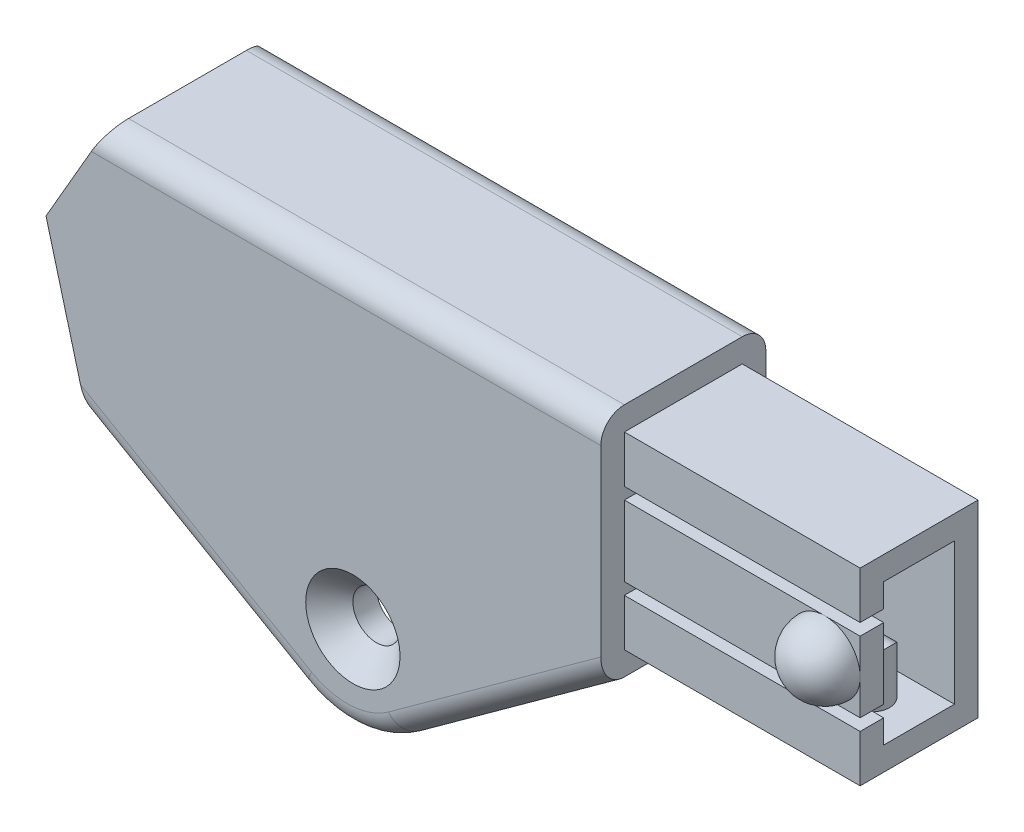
ISO-10303-21;
HEADER;
FILE_DESCRIPTION(('STEP AP214'),'2;1');
FILE_NAME('part.step','',(''),(''),'','','');
FILE_SCHEMA(('AUTOMOTIVE_DESIGN { 1 0 10303 214 1 1 1 1 }'));
ENDSEC;
DATA;
#1=APPLICATION_CONTEXT('core data for automotive mechanical design processes');
#2=APPLICATION_PROTOCOL_DEFINITION('international standard','automotive_design',2000,#1);
#3=PRODUCT_CONTEXT('',#1,'mechanical');
#4=PRODUCT('Part','Part','',(#3));
#5=PRODUCT_RELATED_PRODUCT_CATEGORY('part','',(#4));
#6=PRODUCT_DEFINITION_FORMATION('','',#4);
#7=PRODUCT_DEFINITION_CONTEXT('part definition',#1,'design');
#8=PRODUCT_DEFINITION('design','',#6,#7);
#9=PRODUCT_DEFINITION_SHAPE('','',#8);
#10=(LENGTH_UNIT() NAMED_UNIT(*) SI_UNIT(.MILLI.,.METRE.));
#11=(NAMED_UNIT(*) PLANE_ANGLE_UNIT() SI_UNIT($,.RADIAN.));
#12=(NAMED_UNIT(*) SI_UNIT($,.STERADIAN.) SOLID_ANGLE_UNIT());
#13=UNCERTAINTY_MEASURE_WITH_UNIT(LENGTH_MEASURE(1.E-05),#10,'distance_accuracy_value','');
#14=(GEOMETRIC_REPRESENTATION_CONTEXT(3) GLOBAL_UNCERTAINTY_ASSIGNED_CONTEXT((#13)) GLOBAL_UNIT_ASSIGNED_CONTEXT((#10,
#11,#12)) REPRESENTATION_CONTEXT('',''));
#15=CARTESIAN_POINT('',(0.,0.,0.));
#16=DIRECTION('',(0.,0.,1.));
#17=DIRECTION('',(1.,0.,0.));
#18=AXIS2_PLACEMENT_3D('',#15,#16,#17);
#19=CARTESIAN_POINT('',(-22.,-3.,1.5));
#20=DIRECTION('',(0.,-1.,0.));
#21=DIRECTION('',(0.,0.,-1.));
#22=AXIS2_PLACEMENT_3D('',#19,#20,#21);
#23=PLANE('',#22);
#24=DIRECTION('',(1.,0.,0.));
#25=VECTOR('',#24,1.);
#26=CARTESIAN_POINT('',(-22.,-3.,-1.5));
#27=LINE('',#26,#25);
#28=CARTESIAN_POINT('',(-0.999999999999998,-3.,-1.5));
#29=VERTEX_POINT('',#28);
#30=CARTESIAN_POINT('',(10.,-3.,-1.5));
#31=VERTEX_POINT('',#30);
#32=EDGE_CURVE('E368',#29,#31,#27,.T.);
#33=ORIENTED_EDGE('',*,*,#32,.F.);
#34=DIRECTION('',(0.,0.,1.));
#35=VECTOR('',#34,1.);
#36=CARTESIAN_POINT('',(-0.999999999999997,-3.,1.5));
#37=LINE('',#36,#35);
#38=CARTESIAN_POINT('',(-0.999999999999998,-3.,1.5));
#39=VERTEX_POINT('',#38);
#40=EDGE_CURVE('E477',#29,#39,#37,.T.);
#41=ORIENTED_EDGE('',*,*,#40,.T.);
#42=DIRECTION('',(1.,0.,0.));
#43=VECTOR('',#42,1.);
#44=CARTESIAN_POINT('',(-22.,-3.,1.5));
#45=LINE('',#44,#43);
#46=CARTESIAN_POINT('',(10.,-3.,1.5));
#47=VERTEX_POINT('',#46);
#48=EDGE_CURVE('E362',#39,#47,#45,.T.);
#49=ORIENTED_EDGE('',*,*,#48,.T.);
#50=DIRECTION('',(0.,0.,-1.));
#51=VECTOR('',#50,1.);
#52=CARTESIAN_POINT('',(10.,-3.,1.5));
#53=LINE('',#52,#51);
#54=EDGE_CURVE('E344',#47,#31,#53,.T.);
#55=ORIENTED_EDGE('',*,*,#54,.T.);
#56=EDGE_LOOP('',(#33,#41,#49,#55));
#57=FACE_BOUND('',#56,.T.);
#58=CARTESIAN_POINT('',(8.,-3.,0.));
#59=DIRECTION('',(0.,1.,0.));
#60=DIRECTION('',(0.,0.,1.));
#61=AXIS2_PLACEMENT_3D('',#58,#59,#60);
#62=CIRCLE('',#61,0.75);
#63=CARTESIAN_POINT('',(8.,-3.,0.75));
#64=VERTEX_POINT('',#63);
#65=EDGE_CURVE('E480',#64,#64,#62,.T.);
#66=ORIENTED_EDGE('',*,*,#65,.F.);
#67=EDGE_LOOP('',(#66));
#68=FACE_BOUND('',#67,.T.);
#69=ADVANCED_FACE('F28',(#57,#68),#23,.F.);
#70=CARTESIAN_POINT('',(10.,-4.,2.5));
#71=DIRECTION('',(0.,0.,-1.));
#72=DIRECTION('',(-1.,0.,0.));
#73=AXIS2_PLACEMENT_3D('',#70,#71,#72);
#74=PLANE('',#73);
#75=CARTESIAN_POINT('',(8.5,0.,2.5));
#76=DIRECTION('',(0.,0.,-1.));
#77=DIRECTION('',(1.,0.,0.));
#78=AXIS2_PLACEMENT_3D('',#75,#76,#77);
#79=CIRCLE('',#78,1.5);
#80=CARTESIAN_POINT('',(10.,0.,2.5));
#81=VERTEX_POINT('',#80);
#82=CARTESIAN_POINT('',(8.5,-1.5,2.49999999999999));
#83=VERTEX_POINT('',#82);
#84=EDGE_CURVE('E291',#81,#83,#79,.T.);
#85=ORIENTED_EDGE('',*,*,#84,.T.);
#86=DIRECTION('',(-1.,0.,0.));
#87=VECTOR('',#86,1.);
#88=CARTESIAN_POINT('',(10.,-1.5,2.5));
#89=LINE('',#88,#87);
#90=CARTESIAN_POINT('',(10.,-1.5,2.5));
#91=VERTEX_POINT('',#90);
#92=EDGE_CURVE('E266',#91,#83,#89,.T.);
#93=ORIENTED_EDGE('',*,*,#92,.F.);
#94=DIRECTION('',(0.,-1.,0.));
#95=VECTOR('',#94,1.);
#96=CARTESIAN_POINT('',(10.,-4.,2.5));
#97=LINE('',#96,#95);
#98=EDGE_CURVE('E293',#81,#91,#97,.T.);
#99=ORIENTED_EDGE('',*,*,#98,.F.);
#100=EDGE_LOOP('',(#85,#93,#99));
#101=FACE_BOUND('',#100,.T.);
#102=ADVANCED_FACE('F292',(#101),#74,.F.);
#103=CARTESIAN_POINT('',(8.5,1.5,2.5));
#104=VERTEX_POINT('',#103);
#105=EDGE_CURVE('E299',#104,#81,#79,.T.);
#106=ORIENTED_EDGE('',*,*,#105,.T.);
#107=CARTESIAN_POINT('',(10.,1.5,2.5));
#108=VERTEX_POINT('',#107);
#109=EDGE_CURVE('E419',#108,#81,#97,.T.);
#110=ORIENTED_EDGE('',*,*,#109,.F.);
#111=DIRECTION('',(1.,0.,0.));
#112=VECTOR('',#111,1.);
#113=CARTESIAN_POINT('',(0.,1.5,2.5));
#114=LINE('',#113,#112);
#115=EDGE_CURVE('E372',#104,#108,#114,.T.);
#116=ORIENTED_EDGE('',*,*,#115,.F.);
#117=EDGE_LOOP('',(#106,#110,#116));
#118=FACE_BOUND('',#117,.T.);
#119=ADVANCED_FACE('F569',(#118),#74,.F.);
#120=EDGE_CURVE('E285',#83,#104,#79,.T.);
#121=ORIENTED_EDGE('',*,*,#120,.T.);
#122=CARTESIAN_POINT('',(0.,1.5,2.5));
#123=VERTEX_POINT('',#122);
#124=EDGE_CURVE('E289',#123,#104,#114,.T.);
#125=ORIENTED_EDGE('',*,*,#124,.F.);
#126=DIRECTION('',(0.,-1.,0.));
#127=VECTOR('',#126,1.);
#128=CARTESIAN_POINT('',(0.,-4.,2.5));
#129=LINE('',#128,#127);
#130=CARTESIAN_POINT('',(0.,-1.5,2.5));
#131=VERTEX_POINT('',#130);
#132=EDGE_CURVE('E288',#123,#131,#129,.T.);
#133=ORIENTED_EDGE('',*,*,#132,.T.);
#134=EDGE_CURVE('E270',#83,#131,#89,.T.);
#135=ORIENTED_EDGE('',*,*,#134,.F.);
#136=EDGE_LOOP('',(#121,#125,#133,#135));
#137=FACE_BOUND('',#136,.T.);
#138=ADVANCED_FACE('F282',(#137),#74,.F.);
#139=CARTESIAN_POINT('',(-23.5333209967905,0.669872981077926,3.5));
#140=DIRECTION('',(0.965925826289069,0.258819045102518,0.));
#141=DIRECTION('',(-0.258819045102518,0.965925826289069,0.));
#142=AXIS2_PLACEMENT_3D('',#139,#140,#141);
#143=PLANE('',#142);
#144=DIRECTION('',(0.,0.,-1.));
#145=VECTOR('',#144,1.);
#146=CARTESIAN_POINT('',(-21.7031939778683,-6.16025403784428,3.5));
#147=LINE('',#146,#145);
#148=CARTESIAN_POINT('',(-21.7031939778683,-6.16025403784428,2.5));
#149=VERTEX_POINT('',#148);
#150=CARTESIAN_POINT('',(-21.7031939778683,-6.16025403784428,1.5));
#151=VERTEX_POINT('',#150);
#152=EDGE_CURVE('E454',#149,#151,#147,.T.);
#153=ORIENTED_EDGE('',*,*,#152,.F.);
#154=CARTESIAN_POINT('',(-22.0692193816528,-4.79422863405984,2.5));
#155=DIRECTION('',(0.965925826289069,0.258819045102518,0.));
#156=DIRECTION('',(0.258819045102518,-0.965925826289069,0.));
#157=AXIS2_PLACEMENT_3D('',#154,#155,#156);
#158=ELLIPSE('',#157,1.4142135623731,1.);
#159=CARTESIAN_POINT('',(-22.0692193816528,-4.79422863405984,3.5));
#160=VERTEX_POINT('',#159);
#161=EDGE_CURVE('E523',#149,#160,#158,.F.);
#162=ORIENTED_EDGE('',*,*,#161,.T.);
#163=DIRECTION('',(0.258819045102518,-0.965925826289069,0.));
#164=VECTOR('',#163,1.);
#165=CARTESIAN_POINT('',(-23.5333209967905,0.669872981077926,3.5));
#166=LINE('',#165,#164);
#167=CARTESIAN_POINT('',(-23.5333209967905,0.669872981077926,3.5));
#168=VERTEX_POINT('',#167);
#169=EDGE_CURVE('E450',#168,#160,#166,.T.);
#170=ORIENTED_EDGE('',*,*,#169,.F.);
#171=DIRECTION('',(0.,0.,-1.));
#172=VECTOR('',#171,1.);
#173=CARTESIAN_POINT('',(-23.5333209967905,0.669872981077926,3.5));
#174=LINE('',#173,#172);
#175=CARTESIAN_POINT('',(-23.5333209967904,0.669872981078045,1.5));
#176=VERTEX_POINT('',#175);
#177=EDGE_CURVE('E457',#168,#176,#174,.T.);
#178=ORIENTED_EDGE('',*,*,#177,.T.);
#179=DIRECTION('',(0.258819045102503,-0.965925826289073,0.));
#180=VECTOR('',#179,1.);
#181=CARTESIAN_POINT('',(-21.7031939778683,-6.16025403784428,1.5));
#182=LINE('',#181,#180);
#183=EDGE_CURVE('E311',#176,#151,#182,.T.);
#184=ORIENTED_EDGE('',*,*,#183,.T.);
#185=EDGE_LOOP('',(#153,#162,#170,#178,#184));
#186=FACE_BOUND('',#185,.T.);
#187=ADVANCED_FACE('F632',(#186),#143,.F.);
#188=CARTESIAN_POINT('',(-10.5166604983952,-12.6188021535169,3.5));
#189=DIRECTION('',(0.500000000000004,0.866025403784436,0.));
#190=DIRECTION('',(-0.866025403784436,0.500000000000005,0.));
#191=AXIS2_PLACEMENT_3D('',#188,#189,#190);
#192=PLANE('',#191);
#193=DIRECTION('',(0.,0.,-1.));
#194=VECTOR('',#193,1.);
#195=CARTESIAN_POINT('',(-12.7629010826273,-11.3219345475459,3.5));
#196=LINE('',#195,#194);
#197=CARTESIAN_POINT('',(-12.7629010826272,-11.3219345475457,1.5));
#198=VERTEX_POINT('',#197);
#199=CARTESIAN_POINT('',(-12.7629010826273,-11.3219345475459,2.5));
#200=VERTEX_POINT('',#199);
#201=EDGE_CURVE('E493',#198,#200,#196,.F.);
#202=ORIENTED_EDGE('',*,*,#201,.T.);
#203=DIRECTION('',(0.866025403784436,-0.500000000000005,0.));
#204=VECTOR('',#203,1.);
#205=CARTESIAN_POINT('',(-10.5166604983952,-12.6188021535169,2.5));
#206=LINE('',#205,#204);
#207=EDGE_CURVE('E521',#200,#149,#206,.F.);
#208=ORIENTED_EDGE('',*,*,#207,.T.);
#209=ORIENTED_EDGE('',*,*,#152,.T.);
#210=DIRECTION('',(0.866025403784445,-0.499999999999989,0.));
#211=VECTOR('',#210,1.);
#212=CARTESIAN_POINT('',(-10.5166604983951,-12.6188021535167,1.5));
#213=LINE('',#212,#211);
#214=EDGE_CURVE('E314',#151,#198,#213,.T.);
#215=ORIENTED_EDGE('',*,*,#214,.T.);
#216=EDGE_LOOP('',(#202,#208,#209,#215));
#217=FACE_BOUND('',#216,.T.);
#218=ADVANCED_FACE('F627',(#217),#192,.F.);
#219=CARTESIAN_POINT('',(10.,4.,2.5));
#220=DIRECTION('',(-1.,0.,0.));
#221=DIRECTION('',(0.,0.,1.));
#222=AXIS2_PLACEMENT_3D('',#219,#220,#221);
#223=PLANE('',#222);
#224=DIRECTION('',(0.,0.,1.));
#225=VECTOR('',#224,1.);
#226=CARTESIAN_POINT('',(10.,-1.5,1.5));
#227=LINE('',#226,#225);
#228=CARTESIAN_POINT('',(10.,-1.5,1.5));
#229=VERTEX_POINT('',#228);
#230=EDGE_CURVE('E274',#229,#91,#227,.T.);
#231=ORIENTED_EDGE('',*,*,#230,.F.);
#232=DIRECTION('',(0.,-1.,0.));
#233=VECTOR('',#232,1.);
#234=CARTESIAN_POINT('',(10.,-3.,1.5));
#235=LINE('',#234,#233);
#236=CARTESIAN_POINT('',(10.,1.5,1.5));
#237=VERTEX_POINT('',#236);
#238=EDGE_CURVE('E345',#237,#229,#235,.T.);
#239=ORIENTED_EDGE('',*,*,#238,.F.);
#240=DIRECTION('',(0.,0.,1.));
#241=VECTOR('',#240,1.);
#242=CARTESIAN_POINT('',(10.,1.5,1.5));
#243=LINE('',#242,#241);
#244=EDGE_CURVE('E395',#237,#108,#243,.T.);
#245=ORIENTED_EDGE('',*,*,#244,.T.);
#246=ORIENTED_EDGE('',*,*,#109,.T.);
#247=ORIENTED_EDGE('',*,*,#98,.T.);
#248=EDGE_LOOP('',(#231,#239,#245,#246,#247));
#249=FACE_BOUND('',#248,.T.);
#250=ADVANCED_FACE('F602',(#249),#223,.F.);
#251=CARTESIAN_POINT('',(10.,-2.,2.5));
#252=VERTEX_POINT('',#251);
#253=CARTESIAN_POINT('',(10.,-4.,2.5));
#254=VERTEX_POINT('',#253);
#255=EDGE_CURVE('E414',#252,#254,#97,.T.);
#256=ORIENTED_EDGE('',*,*,#255,.F.);
#257=DIRECTION('',(1.,0.,0.));
#258=VECTOR('',#257,1.);
#259=CARTESIAN_POINT('',(0.,-2.,2.5));
#260=LINE('',#259,#258);
#261=CARTESIAN_POINT('',(0.,-2.,2.5));
#262=VERTEX_POINT('',#261);
#263=EDGE_CURVE('E278',#262,#252,#260,.T.);
#264=ORIENTED_EDGE('',*,*,#263,.F.);
#265=CARTESIAN_POINT('',(0.,-4.,2.5));
#266=VERTEX_POINT('',#265);
#267=EDGE_CURVE('E391',#262,#266,#129,.T.);
#268=ORIENTED_EDGE('',*,*,#267,.T.);
#269=DIRECTION('',(-1.,0.,0.));
#270=VECTOR('',#269,1.);
#271=CARTESIAN_POINT('',(10.,-4.,2.5));
#272=LINE('',#271,#270);
#273=EDGE_CURVE('E434',#254,#266,#272,.T.);
#274=ORIENTED_EDGE('',*,*,#273,.F.);
#275=EDGE_LOOP('',(#256,#264,#268,#274));
#276=FACE_BOUND('',#275,.T.);
#277=ADVANCED_FACE('F645',(#276),#74,.F.);
#278=CARTESIAN_POINT('',(0.,4.,2.5));
#279=VERTEX_POINT('',#278);
#280=CARTESIAN_POINT('',(0.,2.,2.5));
#281=VERTEX_POINT('',#280);
#282=EDGE_CURVE('E402',#279,#281,#129,.T.);
#283=ORIENTED_EDGE('',*,*,#282,.T.);
#284=DIRECTION('',(-1.,0.,0.));
#285=VECTOR('',#284,1.);
#286=CARTESIAN_POINT('',(10.5,2.,2.5));
#287=LINE('',#286,#285);
#288=CARTESIAN_POINT('',(10.,2.,2.5));
#289=VERTEX_POINT('',#288);
#290=EDGE_CURVE('E365',#289,#281,#287,.T.);
#291=ORIENTED_EDGE('',*,*,#290,.F.);
#292=CARTESIAN_POINT('',(10.,4.,2.5));
#293=VERTEX_POINT('',#292);
#294=EDGE_CURVE('E415',#293,#289,#97,.T.);
#295=ORIENTED_EDGE('',*,*,#294,.F.);
#296=DIRECTION('',(-1.,0.,0.));
#297=VECTOR('',#296,1.);
#298=CARTESIAN_POINT('',(10.,4.,2.5));
#299=LINE('',#298,#297);
#300=EDGE_CURVE('E425',#293,#279,#299,.T.);
#301=ORIENTED_EDGE('',*,*,#300,.T.);
#302=EDGE_LOOP('',(#283,#291,#295,#301));
#303=FACE_BOUND('',#302,.T.);
#304=ADVANCED_FACE('F571',(#303),#74,.F.);
#305=CARTESIAN_POINT('',(0.,-5.,3.5));
#306=DIRECTION('',(-1.,0.,0.));
#307=DIRECTION('',(0.,0.,1.));
#308=AXIS2_PLACEMENT_3D('',#305,#306,#307);
#309=PLANE('',#308);
#310=DIRECTION('',(0.,1.,0.));
#311=VECTOR('',#310,1.);
#312=CARTESIAN_POINT('',(0.,-5.,-3.5));
#313=LINE('',#312,#311);
#314=CARTESIAN_POINT('',(0.,-3.76516040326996,-3.5));
#315=VERTEX_POINT('',#314);
#316=CARTESIAN_POINT('',(0.,4.,-3.5));
#317=VERTEX_POINT('',#316);
#318=EDGE_CURVE('E437',#315,#317,#313,.T.);
#319=ORIENTED_EDGE('',*,*,#318,.T.);
#320=CARTESIAN_POINT('',(0.,4.,-2.5));
#321=DIRECTION('',(-1.,0.,0.));
#322=DIRECTION('',(0.,0.,1.));
#323=AXIS2_PLACEMENT_3D('',#320,#321,#322);
#324=CIRCLE('',#323,1.);
#325=CARTESIAN_POINT('',(0.,5.,-2.5));
#326=VERTEX_POINT('',#325);
#327=EDGE_CURVE('E541',#317,#326,#324,.F.);
#328=ORIENTED_EDGE('',*,*,#327,.T.);
#329=DIRECTION('',(0.,0.,-1.));
#330=VECTOR('',#329,1.);
#331=CARTESIAN_POINT('',(0.,5.,3.5));
#332=LINE('',#331,#330);
#333=CARTESIAN_POINT('',(0.,5.,2.5));
#334=VERTEX_POINT('',#333);
#335=EDGE_CURVE('E463',#334,#326,#332,.T.);
#336=ORIENTED_EDGE('',*,*,#335,.F.);
#337=CARTESIAN_POINT('',(0.,4.,2.5));
#338=DIRECTION('',(-1.,0.,0.));
#339=DIRECTION('',(0.,0.,1.));
#340=AXIS2_PLACEMENT_3D('',#337,#338,#339);
#341=CIRCLE('',#340,1.);
#342=CARTESIAN_POINT('',(0.,4.,3.5));
#343=VERTEX_POINT('',#342);
#344=EDGE_CURVE('E536',#334,#343,#341,.F.);
#345=ORIENTED_EDGE('',*,*,#344,.T.);
#346=DIRECTION('',(0.,1.,0.));
#347=VECTOR('',#346,1.);
#348=CARTESIAN_POINT('',(0.,-5.,3.5));
#349=LINE('',#348,#347);
#350=CARTESIAN_POINT('',(0.,-3.76516040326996,3.5));
#351=VERTEX_POINT('',#350);
#352=EDGE_CURVE('E445',#351,#343,#349,.T.);
#353=ORIENTED_EDGE('',*,*,#352,.F.);
#354=CARTESIAN_POINT('',(0.,-3.76516040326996,2.5));
#355=DIRECTION('',(-1.,0.,0.));
#356=DIRECTION('',(0.,1.,0.));
#357=AXIS2_PLACEMENT_3D('',#354,#355,#356);
#358=ELLIPSE('',#357,1.23483959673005,1.);
#359=CARTESIAN_POINT('',(0.,-5.,2.5));
#360=VERTEX_POINT('',#359);
#361=EDGE_CURVE('E50',#351,#360,#358,.F.);
#362=ORIENTED_EDGE('',*,*,#361,.T.);
#363=DIRECTION('',(0.,0.,-1.));
#364=VECTOR('',#363,1.);
#365=CARTESIAN_POINT('',(0.,-5.,3.5));
#366=LINE('',#365,#364);
#367=CARTESIAN_POINT('',(0.,-5.,-2.5));
#368=VERTEX_POINT('',#367);
#369=EDGE_CURVE('E466',#360,#368,#366,.T.);
#370=ORIENTED_EDGE('',*,*,#369,.T.);
#371=CARTESIAN_POINT('',(0.,-3.76516040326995,-2.5));
#372=DIRECTION('',(-1.,0.,0.));
#373=DIRECTION('',(0.,-1.,0.));
#374=AXIS2_PLACEMENT_3D('',#371,#372,#373);
#375=ELLIPSE('',#374,1.23483959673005,1.);
#376=EDGE_CURVE('E539',#368,#315,#375,.F.);
#377=ORIENTED_EDGE('',*,*,#376,.T.);
#378=EDGE_LOOP('',(#319,#328,#336,#345,#353,#362,#370,#377));
#379=FACE_BOUND('',#378,.T.);
#380=ORIENTED_EDGE('',*,*,#282,.F.);
#381=DIRECTION('',(0.,0.,1.));
#382=VECTOR('',#381,1.);
#383=CARTESIAN_POINT('',(0.,4.,2.5));
#384=LINE('',#383,#382);
#385=CARTESIAN_POINT('',(0.,4.,-2.5));
#386=VERTEX_POINT('',#385);
#387=EDGE_CURVE('E411',#386,#279,#384,.T.);
#388=ORIENTED_EDGE('',*,*,#387,.F.);
#389=DIRECTION('',(0.,1.,0.));
#390=VECTOR('',#389,1.);
#391=CARTESIAN_POINT('',(0.,-4.,-2.5));
#392=LINE('',#391,#390);
#393=CARTESIAN_POINT('',(0.,-4.,-2.5));
#394=VERTEX_POINT('',#393);
#395=EDGE_CURVE('E408',#394,#386,#392,.T.);
#396=ORIENTED_EDGE('',*,*,#395,.F.);
#397=DIRECTION('',(0.,0.,-1.));
#398=VECTOR('',#397,1.);
#399=CARTESIAN_POINT('',(0.,-4.,2.5));
#400=LINE('',#399,#398);
#401=EDGE_CURVE('E405',#266,#394,#400,.T.);
#402=ORIENTED_EDGE('',*,*,#401,.F.);
#403=ORIENTED_EDGE('',*,*,#267,.F.);
#404=DIRECTION('',(0.,0.,1.));
#405=VECTOR('',#404,1.);
#406=CARTESIAN_POINT('',(0.,-2.,1.5));
#407=LINE('',#406,#405);
#408=CARTESIAN_POINT('',(0.,-2.,1.5));
#409=VERTEX_POINT('',#408);
#410=EDGE_CURVE('E389',#409,#262,#407,.T.);
#411=ORIENTED_EDGE('',*,*,#410,.F.);
#412=DIRECTION('',(0.,-1.,0.));
#413=VECTOR('',#412,1.);
#414=CARTESIAN_POINT('',(0.,-1.5,1.5));
#415=LINE('',#414,#413);
#416=CARTESIAN_POINT('',(0.,-1.5,1.5));
#417=VERTEX_POINT('',#416);
#418=EDGE_CURVE('E384',#417,#409,#415,.T.);
#419=ORIENTED_EDGE('',*,*,#418,.F.);
#420=DIRECTION('',(0.,0.,1.));
#421=VECTOR('',#420,1.);
#422=CARTESIAN_POINT('',(0.,-1.5,1.5));
#423=LINE('',#422,#421);
#424=EDGE_CURVE('E392',#417,#131,#423,.T.);
#425=ORIENTED_EDGE('',*,*,#424,.T.);
#426=ORIENTED_EDGE('',*,*,#132,.F.);
#427=DIRECTION('',(0.,0.,1.));
#428=VECTOR('',#427,1.);
#429=CARTESIAN_POINT('',(0.,1.5,1.5));
#430=LINE('',#429,#428);
#431=CARTESIAN_POINT('',(0.,1.5,1.5));
#432=VERTEX_POINT('',#431);
#433=EDGE_CURVE('E398',#432,#123,#430,.T.);
#434=ORIENTED_EDGE('',*,*,#433,.F.);
#435=DIRECTION('',(0.,-1.,0.));
#436=VECTOR('',#435,1.);
#437=CARTESIAN_POINT('',(0.,2.,1.5));
#438=LINE('',#437,#436);
#439=CARTESIAN_POINT('',(0.,2.,1.5));
#440=VERTEX_POINT('',#439);
#441=EDGE_CURVE('E378',#440,#432,#438,.T.);
#442=ORIENTED_EDGE('',*,*,#441,.F.);
#443=DIRECTION('',(0.,0.,1.));
#444=VECTOR('',#443,1.);
#445=CARTESIAN_POINT('',(0.,2.,1.5));
#446=LINE('',#445,#444);
#447=EDGE_CURVE('E388',#440,#281,#446,.T.);
#448=ORIENTED_EDGE('',*,*,#447,.T.);
#449=EDGE_LOOP('',(#380,#388,#396,#402,#403,#411,#419,#425,#426,#434,#442,#448));
#450=FACE_BOUND('',#449,.T.);
#451=ADVANCED_FACE('F639',(#379,#450),#309,.F.);
#452=CARTESIAN_POINT('',(-10.5166604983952,-12.6188021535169,3.5));
#453=DIRECTION('',(-0.58667596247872,0.809821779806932,0.));
#454=DIRECTION('',(-0.809821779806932,-0.58667596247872,0.));
#455=AXIS2_PLACEMENT_3D('',#452,#453,#454);
#456=PLANE('',#455);
#457=DIRECTION('',(0.,0.,-1.));
#458=VECTOR('',#457,1.);
#459=CARTESIAN_POINT('',(-8.41619723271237,-11.0971200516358,3.5));
#460=LINE('',#459,#458);
#461=CARTESIAN_POINT('',(-8.41619723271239,-11.0971200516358,-1.5));
#462=VERTEX_POINT('',#461);
#463=CARTESIAN_POINT('',(-8.41619723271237,-11.0971200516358,-2.5));
#464=VERTEX_POINT('',#463);
#465=EDGE_CURVE('E485',#462,#464,#460,.T.);
#466=ORIENTED_EDGE('',*,*,#465,.T.);
#467=DIRECTION('',(0.809821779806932,0.58667596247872,0.));
#468=VECTOR('',#467,1.);
#469=CARTESIAN_POINT('',(0.,-5.,-2.5));
#470=LINE('',#469,#468);
#471=EDGE_CURVE('E43',#464,#368,#470,.T.);
#472=ORIENTED_EDGE('',*,*,#471,.T.);
#473=ORIENTED_EDGE('',*,*,#369,.F.);
#474=DIRECTION('',(0.809821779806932,0.58667596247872,0.));
#475=VECTOR('',#474,1.);
#476=CARTESIAN_POINT('',(-10.5166604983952,-12.6188021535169,2.5));
#477=LINE('',#476,#475);
#478=CARTESIAN_POINT('',(-8.41619723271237,-11.0971200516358,2.5));
#479=VERTEX_POINT('',#478);
#480=EDGE_CURVE('E543',#360,#479,#477,.F.);
#481=ORIENTED_EDGE('',*,*,#480,.T.);
#482=DIRECTION('',(0.,0.,-1.));
#483=VECTOR('',#482,1.);
#484=CARTESIAN_POINT('',(-8.41619723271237,-11.0971200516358,3.5));
#485=LINE('',#484,#483);
#486=CARTESIAN_POINT('',(-8.41619723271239,-11.0971200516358,1.5));
#487=VERTEX_POINT('',#486);
#488=EDGE_CURVE('E483',#479,#487,#485,.T.);
#489=ORIENTED_EDGE('',*,*,#488,.T.);
#490=DIRECTION('',(0.809821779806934,0.586675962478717,0.));
#491=VECTOR('',#490,1.);
#492=CARTESIAN_POINT('',(-0.999999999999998,-5.72445070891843,1.5));
#493=LINE('',#492,#491);
#494=CARTESIAN_POINT('',(-0.999999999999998,-5.72445070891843,1.5));
#495=VERTEX_POINT('',#494);
#496=EDGE_CURVE('E317',#487,#495,#493,.T.);
#497=ORIENTED_EDGE('',*,*,#496,.T.);
#498=DIRECTION('',(0.,0.,1.));
#499=VECTOR('',#498,1.);
#500=CARTESIAN_POINT('',(-0.999999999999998,-5.72445070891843,-1.5));
#501=LINE('',#500,#499);
#502=CARTESIAN_POINT('',(-0.999999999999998,-5.72445070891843,-1.5));
#503=VERTEX_POINT('',#502);
#504=EDGE_CURVE('E335',#503,#495,#501,.T.);
#505=ORIENTED_EDGE('',*,*,#504,.F.);
#506=DIRECTION('',(0.809821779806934,0.586675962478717,0.));
#507=VECTOR('',#506,1.);
#508=CARTESIAN_POINT('',(-0.999999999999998,-5.72445070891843,-1.5));
#509=LINE('',#508,#507);
#510=EDGE_CURVE('E328',#462,#503,#509,.T.);
#511=ORIENTED_EDGE('',*,*,#510,.F.);
#512=EDGE_LOOP('',(#466,#472,#473,#481,#489,#497,#505,#511));
#513=FACE_BOUND('',#512,.T.);
#514=ADVANCED_FACE('F30',(#513),#456,.F.);
#515=CARTESIAN_POINT('',(-21.0333209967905,5.00000000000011,3.5));
#516=DIRECTION('',(0.,-1.,0.));
#517=DIRECTION('',(1.,0.,0.));
#518=AXIS2_PLACEMENT_3D('',#515,#516,#517);
#519=PLANE('',#518);
#520=ORIENTED_EDGE('',*,*,#335,.T.);
#521=DIRECTION('',(-1.,0.,0.));
#522=VECTOR('',#521,1.);
#523=CARTESIAN_POINT('',(-21.0333209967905,5.00000000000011,-2.5));
#524=LINE('',#523,#522);
#525=CARTESIAN_POINT('',(-21.0333209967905,5.00000000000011,-2.5));
#526=VERTEX_POINT('',#525);
#527=EDGE_CURVE('E529',#326,#526,#524,.T.);
#528=ORIENTED_EDGE('',*,*,#527,.T.);
#529=DIRECTION('',(0.,0.,-1.));
#530=VECTOR('',#529,1.);
#531=CARTESIAN_POINT('',(-21.0333209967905,5.00000000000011,3.5));
#532=LINE('',#531,#530);
#533=CARTESIAN_POINT('',(-21.0333209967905,5.00000000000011,2.5));
#534=VERTEX_POINT('',#533);
#535=EDGE_CURVE('E460',#534,#526,#532,.T.);
#536=ORIENTED_EDGE('',*,*,#535,.F.);
#537=DIRECTION('',(-1.,0.,0.));
#538=VECTOR('',#537,1.);
#539=CARTESIAN_POINT('',(-21.0333209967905,5.00000000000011,2.5));
#540=LINE('',#539,#538);
#541=EDGE_CURVE('E527',#534,#334,#540,.F.);
#542=ORIENTED_EDGE('',*,*,#541,.T.);
#543=EDGE_LOOP('',(#520,#528,#536,#542));
#544=FACE_BOUND('',#543,.T.);
#545=ADVANCED_FACE('F635',(#544),#519,.F.);
#546=CARTESIAN_POINT('',(-21.0333209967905,5.00000000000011,3.5));
#547=DIRECTION('',(0.866025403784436,-0.500000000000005,0.));
#548=DIRECTION('',(0.500000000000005,0.866025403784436,0.));
#549=AXIS2_PLACEMENT_3D('',#546,#547,#548);
#550=PLANE('',#549);
#551=ORIENTED_EDGE('',*,*,#535,.T.);
#552=CARTESIAN_POINT('',(-21.6106712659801,4.00000000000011,-2.5));
#553=DIRECTION('',(0.866025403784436,-0.500000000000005,0.));
#554=DIRECTION('',(0.500000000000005,0.866025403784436,0.));
#555=AXIS2_PLACEMENT_3D('',#552,#553,#554);
#556=ELLIPSE('',#555,1.15470053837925,1.);
#557=CARTESIAN_POINT('',(-21.6106712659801,4.00000000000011,-3.5));
#558=VERTEX_POINT('',#557);
#559=EDGE_CURVE('E534',#526,#558,#556,.F.);
#560=ORIENTED_EDGE('',*,*,#559,.T.);
#561=DIRECTION('',(-0.500000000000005,-0.866025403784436,0.));
#562=VECTOR('',#561,1.);
#563=CARTESIAN_POINT('',(-21.0333209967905,5.00000000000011,-3.5));
#564=LINE('',#563,#562);
#565=CARTESIAN_POINT('',(-23.5333209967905,0.669872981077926,-3.5));
#566=VERTEX_POINT('',#565);
#567=EDGE_CURVE('E440',#558,#566,#564,.T.);
#568=ORIENTED_EDGE('',*,*,#567,.T.);
#569=CARTESIAN_POINT('',(-23.5333209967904,0.669872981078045,-1.5));
#570=VERTEX_POINT('',#569);
#571=EDGE_CURVE('E456',#570,#566,#174,.T.);
#572=ORIENTED_EDGE('',*,*,#571,.F.);
#573=DIRECTION('',(0.,0.,1.));
#574=VECTOR('',#573,1.);
#575=CARTESIAN_POINT('',(-23.5333209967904,0.669872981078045,-1.5));
#576=LINE('',#575,#574);
#577=EDGE_CURVE('E336',#570,#176,#576,.T.);
#578=ORIENTED_EDGE('',*,*,#577,.T.);
#579=ORIENTED_EDGE('',*,*,#177,.F.);
#580=DIRECTION('',(-0.500000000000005,-0.866025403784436,0.));
#581=VECTOR('',#580,1.);
#582=CARTESIAN_POINT('',(-21.0333209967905,5.00000000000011,3.5));
#583=LINE('',#582,#581);
#584=CARTESIAN_POINT('',(-21.6106712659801,4.00000000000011,3.5));
#585=VERTEX_POINT('',#584);
#586=EDGE_CURVE('E448',#585,#168,#583,.T.);
#587=ORIENTED_EDGE('',*,*,#586,.F.);
#588=CARTESIAN_POINT('',(-21.6106712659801,4.00000000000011,2.5));
#589=DIRECTION('',(0.866025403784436,-0.500000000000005,0.));
#590=DIRECTION('',(-0.500000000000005,-0.866025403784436,0.));
#591=AXIS2_PLACEMENT_3D('',#588,#589,#590);
#592=ELLIPSE('',#591,1.15470053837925,1.);
#593=EDGE_CURVE('E532',#585,#534,#592,.F.);
#594=ORIENTED_EDGE('',*,*,#593,.T.);
#595=EDGE_LOOP('',(#551,#560,#568,#572,#578,#579,#587,#594));
#596=FACE_BOUND('',#595,.T.);
#597=ADVANCED_FACE('F630',(#596),#550,.F.);
#598=DIRECTION('',(0.258819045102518,-0.965925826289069,0.));
#599=VECTOR('',#598,1.);
#600=CARTESIAN_POINT('',(-23.5333209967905,0.669872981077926,-3.5));
#601=LINE('',#600,#599);
#602=CARTESIAN_POINT('',(-22.0692193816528,-4.79422863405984,-3.5));
#603=VERTEX_POINT('',#602);
#604=EDGE_CURVE('E442',#566,#603,#601,.T.);
#605=ORIENTED_EDGE('',*,*,#604,.T.);
#606=CARTESIAN_POINT('',(-22.0692193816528,-4.79422863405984,-2.5));
#607=DIRECTION('',(0.965925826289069,0.258819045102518,0.));
#608=DIRECTION('',(-0.258819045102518,0.965925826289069,0.));
#609=AXIS2_PLACEMENT_3D('',#606,#607,#608);
#610=ELLIPSE('',#609,1.4142135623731,1.);
#611=CARTESIAN_POINT('',(-21.7031939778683,-6.16025403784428,-2.5));
#612=VERTEX_POINT('',#611);
#613=EDGE_CURVE('E507',#603,#612,#610,.F.);
#614=ORIENTED_EDGE('',*,*,#613,.T.);
#615=CARTESIAN_POINT('',(-21.7031939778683,-6.16025403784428,-1.5));
#616=VERTEX_POINT('',#615);
#617=EDGE_CURVE('E453',#616,#612,#147,.T.);
#618=ORIENTED_EDGE('',*,*,#617,.F.);
#619=DIRECTION('',(0.258819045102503,-0.965925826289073,0.));
#620=VECTOR('',#619,1.);
#621=CARTESIAN_POINT('',(-21.7031939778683,-6.16025403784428,-1.5));
#622=LINE('',#621,#620);
#623=EDGE_CURVE('E323',#570,#616,#622,.T.);
#624=ORIENTED_EDGE('',*,*,#623,.F.);
#625=ORIENTED_EDGE('',*,*,#571,.T.);
#626=EDGE_LOOP('',(#605,#614,#618,#624,#625));
#627=FACE_BOUND('',#626,.T.);
#628=ADVANCED_FACE('F625',(#627),#143,.F.);
#629=ORIENTED_EDGE('',*,*,#617,.T.);
#630=DIRECTION('',(0.866025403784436,-0.500000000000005,0.));
#631=VECTOR('',#630,1.);
#632=CARTESIAN_POINT('',(-12.7629010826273,-11.3219345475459,-2.5));
#633=LINE('',#632,#631);
#634=CARTESIAN_POINT('',(-12.7629010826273,-11.3219345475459,-2.5));
#635=VERTEX_POINT('',#634);
#636=EDGE_CURVE('E496',#612,#635,#633,.T.);
#637=ORIENTED_EDGE('',*,*,#636,.T.);
#638=DIRECTION('',(0.,0.,-1.));
#639=VECTOR('',#638,1.);
#640=CARTESIAN_POINT('',(-12.7629010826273,-11.3219345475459,3.5));
#641=LINE('',#640,#639);
#642=CARTESIAN_POINT('',(-12.7629010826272,-11.3219345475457,-1.5));
#643=VERTEX_POINT('',#642);
#644=EDGE_CURVE('E487',#635,#643,#641,.F.);
#645=ORIENTED_EDGE('',*,*,#644,.T.);
#646=DIRECTION('',(0.866025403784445,-0.499999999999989,0.));
#647=VECTOR('',#646,1.);
#648=CARTESIAN_POINT('',(-10.5166604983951,-12.6188021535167,-1.5));
#649=LINE('',#648,#647);
#650=EDGE_CURVE('E325',#616,#643,#649,.T.);
#651=ORIENTED_EDGE('',*,*,#650,.F.);
#652=EDGE_LOOP('',(#629,#637,#645,#651));
#653=FACE_BOUND('',#652,.T.);
#654=ADVANCED_FACE('F621',(#653),#192,.F.);
#655=CARTESIAN_POINT('',(-18.4354647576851,-18.3555855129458,3.5));
#656=DIRECTION('',(0.,0.,-1.));
#657=DIRECTION('',(-1.,0.,0.));
#658=AXIS2_PLACEMENT_3D('',#655,#656,#657);
#659=PLANE('',#658);
#660=CARTESIAN_POINT('',(-10.5166604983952,-7.99999999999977,3.5));
#661=DIRECTION('',(0.,0.,-1.));
#662=DIRECTION('',(-1.,0.,0.));
#663=AXIS2_PLACEMENT_3D('',#660,#661,#662);
#664=CIRCLE('',#663,2.00000000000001);
#665=CARTESIAN_POINT('',(-12.5166604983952,-7.99999999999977,3.5));
#666=VERTEX_POINT('',#665);
#667=EDGE_CURVE('E11',#666,#666,#664,.T.);
#668=ORIENTED_EDGE('',*,*,#667,.T.);
#669=EDGE_LOOP('',(#668));
#670=FACE_BOUND('',#669,.T.);
#671=ORIENTED_EDGE('',*,*,#169,.T.);
#672=DIRECTION('',(0.866025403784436,-0.500000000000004,0.));
#673=VECTOR('',#672,1.);
#674=CARTESIAN_POINT('',(-13.4716636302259,-9.75802976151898,3.5));
#675=LINE('',#674,#673);
#676=CARTESIAN_POINT('',(-12.2629010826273,-10.4559091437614,3.5));
#677=VERTEX_POINT('',#676);
#678=EDGE_CURVE('E518',#160,#677,#675,.T.);
#679=ORIENTED_EDGE('',*,*,#678,.T.);
#680=CARTESIAN_POINT('',(-10.7629010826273,-7.85783293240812,3.5));
#681=DIRECTION('',(0.,0.,-1.));
#682=DIRECTION('',(-1.,0.,0.));
#683=AXIS2_PLACEMENT_3D('',#680,#681,#682);
#684=CIRCLE('',#683,3.);
#685=CARTESIAN_POINT('',(-9.00287319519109,-10.2872982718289,3.5));
#686=VERTEX_POINT('',#685);
#687=EDGE_CURVE('E516',#677,#686,#684,.F.);
#688=ORIENTED_EDGE('',*,*,#687,.T.);
#689=DIRECTION('',(0.809821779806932,0.58667596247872,0.));
#690=VECTOR('',#689,1.);
#691=CARTESIAN_POINT('',(-19.0221407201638,-17.5457637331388,3.5));
#692=LINE('',#691,#690);
#693=EDGE_CURVE('E514',#686,#351,#692,.T.);
#694=ORIENTED_EDGE('',*,*,#693,.T.);
#695=ORIENTED_EDGE('',*,*,#352,.T.);
#696=DIRECTION('',(-1.,0.,0.));
#697=VECTOR('',#696,1.);
#698=CARTESIAN_POINT('',(-18.435464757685,4.00000000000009,3.5));
#699=LINE('',#698,#697);
#700=EDGE_CURVE('E511',#343,#585,#699,.T.);
#701=ORIENTED_EDGE('',*,*,#700,.T.);
#702=ORIENTED_EDGE('',*,*,#586,.T.);
#703=EDGE_LOOP('',(#671,#679,#688,#694,#695,#701,#702));
#704=FACE_BOUND('',#703,.T.);
#705=ADVANCED_FACE('F617',(#670,#704),#659,.F.);
#706=CARTESIAN_POINT('',(-18.4354647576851,-18.3555855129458,-3.5));
#707=DIRECTION('',(0.,0.,-1.));
#708=DIRECTION('',(-1.,0.,0.));
#709=AXIS2_PLACEMENT_3D('',#706,#707,#708);
#710=PLANE('',#709);
#711=CARTESIAN_POINT('',(-10.5166604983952,-7.99999999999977,-3.5));
#712=DIRECTION('',(0.,0.,1.));
#713=DIRECTION('',(1.,0.,0.));
#714=AXIS2_PLACEMENT_3D('',#711,#712,#713);
#715=CIRCLE('',#714,1.);
#716=CARTESIAN_POINT('',(-9.5166604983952,-7.99999999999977,-3.5));
#717=VERTEX_POINT('',#716);
#718=EDGE_CURVE('E297',#717,#717,#715,.T.);
#719=ORIENTED_EDGE('',*,*,#718,.T.);
#720=EDGE_LOOP('',(#719));
#721=FACE_BOUND('',#720,.T.);
#722=ORIENTED_EDGE('',*,*,#567,.F.);
#723=DIRECTION('',(-1.,0.,0.));
#724=VECTOR('',#723,1.);
#725=CARTESIAN_POINT('',(0.,4.,-3.5));
#726=LINE('',#725,#724);
#727=EDGE_CURVE('E505',#558,#317,#726,.F.);
#728=ORIENTED_EDGE('',*,*,#727,.T.);
#729=ORIENTED_EDGE('',*,*,#318,.F.);
#730=DIRECTION('',(0.809821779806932,0.58667596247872,0.));
#731=VECTOR('',#730,1.);
#732=CARTESIAN_POINT('',(-9.0028731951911,-10.2872982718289,-3.5));
#733=LINE('',#732,#731);
#734=CARTESIAN_POINT('',(-9.00287319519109,-10.2872982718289,-3.5));
#735=VERTEX_POINT('',#734);
#736=EDGE_CURVE('E499',#315,#735,#733,.F.);
#737=ORIENTED_EDGE('',*,*,#736,.T.);
#738=CARTESIAN_POINT('',(-10.7629010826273,-7.85783293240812,-3.5));
#739=DIRECTION('',(0.,0.,-1.));
#740=DIRECTION('',(-1.,0.,0.));
#741=AXIS2_PLACEMENT_3D('',#738,#739,#740);
#742=CIRCLE('',#741,3.);
#743=CARTESIAN_POINT('',(-12.2629010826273,-10.4559091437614,-3.5));
#744=VERTEX_POINT('',#743);
#745=EDGE_CURVE('E501',#735,#744,#742,.T.);
#746=ORIENTED_EDGE('',*,*,#745,.T.);
#747=DIRECTION('',(0.866025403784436,-0.500000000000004,0.));
#748=VECTOR('',#747,1.);
#749=CARTESIAN_POINT('',(-21.2031939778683,-5.29422863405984,-3.5));
#750=LINE('',#749,#748);
#751=EDGE_CURVE('E503',#744,#603,#750,.F.);
#752=ORIENTED_EDGE('',*,*,#751,.T.);
#753=ORIENTED_EDGE('',*,*,#604,.F.);
#754=EDGE_LOOP('',(#722,#728,#729,#737,#746,#752,#753));
#755=FACE_BOUND('',#754,.T.);
#756=ADVANCED_FACE('F612',(#721,#755),#710,.T.);
#757=CARTESIAN_POINT('',(10.,-4.,2.5));
#758=DIRECTION('',(0.,1.,0.));
#759=DIRECTION('',(0.,0.,1.));
#760=AXIS2_PLACEMENT_3D('',#757,#758,#759);
#761=PLANE('',#760);
#762=ORIENTED_EDGE('',*,*,#401,.T.);
#763=DIRECTION('',(-1.,0.,0.));
#764=VECTOR('',#763,1.);
#765=CARTESIAN_POINT('',(10.,-4.,-2.5));
#766=LINE('',#765,#764);
#767=CARTESIAN_POINT('',(10.,-4.,-2.5));
#768=VERTEX_POINT('',#767);
#769=EDGE_CURVE('E431',#768,#394,#766,.T.);
#770=ORIENTED_EDGE('',*,*,#769,.F.);
#771=DIRECTION('',(0.,0.,-1.));
#772=VECTOR('',#771,1.);
#773=CARTESIAN_POINT('',(10.,-4.,2.5));
#774=LINE('',#773,#772);
#775=EDGE_CURVE('E418',#254,#768,#774,.T.);
#776=ORIENTED_EDGE('',*,*,#775,.F.);
#777=ORIENTED_EDGE('',*,*,#273,.T.);
#778=EDGE_LOOP('',(#762,#770,#776,#777));
#779=FACE_BOUND('',#778,.T.);
#780=ADVANCED_FACE('F609',(#779),#761,.F.);
#781=CARTESIAN_POINT('',(10.,-4.,-2.5));
#782=DIRECTION('',(0.,0.,1.));
#783=DIRECTION('',(0.,-1.,0.));
#784=AXIS2_PLACEMENT_3D('',#781,#782,#783);
#785=PLANE('',#784);
#786=ORIENTED_EDGE('',*,*,#395,.T.);
#787=DIRECTION('',(-1.,0.,0.));
#788=VECTOR('',#787,1.);
#789=CARTESIAN_POINT('',(10.,4.,-2.5));
#790=LINE('',#789,#788);
#791=CARTESIAN_POINT('',(10.,4.,-2.5));
#792=VERTEX_POINT('',#791);
#793=EDGE_CURVE('E428',#792,#386,#790,.T.);
#794=ORIENTED_EDGE('',*,*,#793,.F.);
#795=DIRECTION('',(0.,1.,0.));
#796=VECTOR('',#795,1.);
#797=CARTESIAN_POINT('',(10.,-4.,-2.5));
#798=LINE('',#797,#796);
#799=EDGE_CURVE('E421',#768,#792,#798,.T.);
#800=ORIENTED_EDGE('',*,*,#799,.F.);
#801=ORIENTED_EDGE('',*,*,#769,.T.);
#802=EDGE_LOOP('',(#786,#794,#800,#801));
#803=FACE_BOUND('',#802,.T.);
#804=ADVANCED_FACE('F605',(#803),#785,.F.);
#805=CARTESIAN_POINT('',(10.,4.,2.5));
#806=DIRECTION('',(0.,-1.,0.));
#807=DIRECTION('',(0.,0.,-1.));
#808=AXIS2_PLACEMENT_3D('',#805,#806,#807);
#809=PLANE('',#808);
#810=ORIENTED_EDGE('',*,*,#387,.T.);
#811=ORIENTED_EDGE('',*,*,#300,.F.);
#812=DIRECTION('',(0.,0.,1.));
#813=VECTOR('',#812,1.);
#814=CARTESIAN_POINT('',(10.,4.,2.5));
#815=LINE('',#814,#813);
#816=EDGE_CURVE('E423',#792,#293,#815,.T.);
#817=ORIENTED_EDGE('',*,*,#816,.F.);
#818=ORIENTED_EDGE('',*,*,#793,.T.);
#819=EDGE_LOOP('',(#810,#811,#817,#818));
#820=FACE_BOUND('',#819,.T.);
#821=ADVANCED_FACE('F600',(#820),#809,.F.);
#822=ORIENTED_EDGE('',*,*,#54,.F.);
#823=CARTESIAN_POINT('',(10.,-2.,1.5));
#824=VERTEX_POINT('',#823);
#825=EDGE_CURVE('E339',#824,#47,#235,.T.);
#826=ORIENTED_EDGE('',*,*,#825,.F.);
#827=DIRECTION('',(0.,0.,1.));
#828=VECTOR('',#827,1.);
#829=CARTESIAN_POINT('',(10.,-2.,2.5));
#830=LINE('',#829,#828);
#831=EDGE_CURVE('E468',#824,#252,#830,.T.);
#832=ORIENTED_EDGE('',*,*,#831,.T.);
#833=ORIENTED_EDGE('',*,*,#255,.T.);
#834=ORIENTED_EDGE('',*,*,#775,.T.);
#835=ORIENTED_EDGE('',*,*,#799,.T.);
#836=ORIENTED_EDGE('',*,*,#816,.T.);
#837=ORIENTED_EDGE('',*,*,#294,.T.);
#838=DIRECTION('',(0.,0.,-1.));
#839=VECTOR('',#838,1.);
#840=CARTESIAN_POINT('',(10.,2.,2.5));
#841=LINE('',#840,#839);
#842=CARTESIAN_POINT('',(10.,2.,1.5));
#843=VERTEX_POINT('',#842);
#844=EDGE_CURVE('E471',#289,#843,#841,.T.);
#845=ORIENTED_EDGE('',*,*,#844,.T.);
#846=CARTESIAN_POINT('',(10.,3.,1.5));
#847=VERTEX_POINT('',#846);
#848=EDGE_CURVE('E342',#847,#843,#235,.T.);
#849=ORIENTED_EDGE('',*,*,#848,.F.);
#850=DIRECTION('',(0.,0.,1.));
#851=VECTOR('',#850,1.);
#852=CARTESIAN_POINT('',(10.,3.,1.5));
#853=LINE('',#852,#851);
#854=CARTESIAN_POINT('',(10.,3.,-1.5));
#855=VERTEX_POINT('',#854);
#856=EDGE_CURVE('E351',#855,#847,#853,.T.);
#857=ORIENTED_EDGE('',*,*,#856,.F.);
#858=DIRECTION('',(0.,1.,0.));
#859=VECTOR('',#858,1.);
#860=CARTESIAN_POINT('',(10.,-3.,-1.5));
#861=LINE('',#860,#859);
#862=EDGE_CURVE('E348',#31,#855,#861,.T.);
#863=ORIENTED_EDGE('',*,*,#862,.F.);
#864=EDGE_LOOP('',(#822,#826,#832,#833,#834,#835,#836,#837,#845,#849,#857,#863));
#865=FACE_BOUND('',#864,.T.);
#866=ADVANCED_FACE('F593',(#865),#223,.F.);
#867=CARTESIAN_POINT('',(0.,1.5,1.5));
#868=DIRECTION('',(0.,-1.,0.));
#869=DIRECTION('',(0.,0.,-1.));
#870=AXIS2_PLACEMENT_3D('',#867,#868,#869);
#871=PLANE('',#870);
#872=ORIENTED_EDGE('',*,*,#124,.T.);
#873=ORIENTED_EDGE('',*,*,#115,.T.);
#874=ORIENTED_EDGE('',*,*,#244,.F.);
#875=DIRECTION('',(1.,0.,0.));
#876=VECTOR('',#875,1.);
#877=CARTESIAN_POINT('',(0.,1.5,1.5));
#878=LINE('',#877,#876);
#879=EDGE_CURVE('E380',#432,#237,#878,.T.);
#880=ORIENTED_EDGE('',*,*,#879,.F.);
#881=ORIENTED_EDGE('',*,*,#433,.T.);
#882=EDGE_LOOP('',(#872,#873,#874,#880,#881));
#883=FACE_BOUND('',#882,.T.);
#884=ADVANCED_FACE('F590',(#883),#871,.F.);
#885=CARTESIAN_POINT('',(10.5,2.,1.5));
#886=DIRECTION('',(0.,1.,0.));
#887=DIRECTION('',(-1.,0.,0.));
#888=AXIS2_PLACEMENT_3D('',#885,#886,#887);
#889=PLANE('',#888);
#890=ORIENTED_EDGE('',*,*,#290,.T.);
#891=ORIENTED_EDGE('',*,*,#447,.F.);
#892=DIRECTION('',(-1.,0.,0.));
#893=VECTOR('',#892,1.);
#894=CARTESIAN_POINT('',(10.5,2.,1.5));
#895=LINE('',#894,#893);
#896=EDGE_CURVE('E376',#843,#440,#895,.T.);
#897=ORIENTED_EDGE('',*,*,#896,.F.);
#898=ORIENTED_EDGE('',*,*,#844,.F.);
#899=EDGE_LOOP('',(#890,#891,#897,#898));
#900=FACE_BOUND('',#899,.T.);
#901=ADVANCED_FACE('F586',(#900),#889,.F.);
#902=CARTESIAN_POINT('',(0.,-2.,1.5));
#903=DIRECTION('',(0.,-1.,0.));
#904=DIRECTION('',(1.,0.,0.));
#905=AXIS2_PLACEMENT_3D('',#902,#903,#904);
#906=PLANE('',#905);
#907=DIRECTION('',(1.,0.,0.));
#908=VECTOR('',#907,1.);
#909=CARTESIAN_POINT('',(0.,-2.,1.5));
#910=LINE('',#909,#908);
#911=EDGE_CURVE('E386',#409,#824,#910,.T.);
#912=ORIENTED_EDGE('',*,*,#911,.F.);
#913=ORIENTED_EDGE('',*,*,#410,.T.);
#914=ORIENTED_EDGE('',*,*,#263,.T.);
#915=ORIENTED_EDGE('',*,*,#831,.F.);
#916=EDGE_LOOP('',(#912,#913,#914,#915));
#917=FACE_BOUND('',#916,.T.);
#918=ADVANCED_FACE('F583',(#917),#906,.F.);
#919=CARTESIAN_POINT('',(10.,-1.5,1.5));
#920=DIRECTION('',(0.,1.,0.));
#921=DIRECTION('',(0.,0.,1.));
#922=AXIS2_PLACEMENT_3D('',#919,#920,#921);
#923=PLANE('',#922);
#924=ORIENTED_EDGE('',*,*,#92,.T.);
#925=ORIENTED_EDGE('',*,*,#134,.T.);
#926=ORIENTED_EDGE('',*,*,#424,.F.);
#927=DIRECTION('',(-1.,0.,0.));
#928=VECTOR('',#927,1.);
#929=CARTESIAN_POINT('',(10.,-1.5,1.5));
#930=LINE('',#929,#928);
#931=EDGE_CURVE('E382',#229,#417,#930,.T.);
#932=ORIENTED_EDGE('',*,*,#931,.F.);
#933=ORIENTED_EDGE('',*,*,#230,.T.);
#934=EDGE_LOOP('',(#924,#925,#926,#932,#933));
#935=FACE_BOUND('',#934,.T.);
#936=ADVANCED_FACE('F268',(#935),#923,.F.);
#937=CARTESIAN_POINT('',(-22.,-3.,1.5));
#938=DIRECTION('',(0.,0.,1.));
#939=DIRECTION('',(1.,0.,0.));
#940=AXIS2_PLACEMENT_3D('',#937,#938,#939);
#941=PLANE('',#940);
#942=CARTESIAN_POINT('',(-10.5166604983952,-7.99999999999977,1.5));
#943=DIRECTION('',(0.,0.,1.));
#944=DIRECTION('',(1.,0.,0.));
#945=AXIS2_PLACEMENT_3D('',#942,#943,#944);
#946=CIRCLE('',#945,1.);
#947=CARTESIAN_POINT('',(-9.5166604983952,-7.99999999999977,1.5));
#948=VERTEX_POINT('',#947);
#949=EDGE_CURVE('E308',#948,#948,#946,.T.);
#950=ORIENTED_EDGE('',*,*,#949,.T.);
#951=EDGE_LOOP('',(#950));
#952=FACE_BOUND('',#951,.T.);
#953=ORIENTED_EDGE('',*,*,#496,.F.);
#954=CARTESIAN_POINT('',(-10.7629010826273,-7.85783293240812,1.5));
#955=DIRECTION('',(0.,0.,1.));
#956=DIRECTION('',(1.,0.,0.));
#957=AXIS2_PLACEMENT_3D('',#954,#955,#956);
#958=CIRCLE('',#957,4.);
#959=EDGE_CURVE('E491',#487,#198,#958,.F.);
#960=ORIENTED_EDGE('',*,*,#959,.T.);
#961=ORIENTED_EDGE('',*,*,#214,.F.);
#962=ORIENTED_EDGE('',*,*,#183,.F.);
#963=DIRECTION('',(-1.,0.,0.));
#964=VECTOR('',#963,1.);
#965=CARTESIAN_POINT('',(-23.5333209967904,0.669872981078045,1.5));
#966=LINE('',#965,#964);
#967=CARTESIAN_POINT('',(-22.,0.669872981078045,1.5));
#968=VERTEX_POINT('',#967);
#969=EDGE_CURVE('E321',#968,#176,#966,.T.);
#970=ORIENTED_EDGE('',*,*,#969,.F.);
#971=DIRECTION('',(0.,-1.,0.));
#972=VECTOR('',#971,1.);
#973=CARTESIAN_POINT('',(-22.,-3.,1.5));
#974=LINE('',#973,#972);
#975=CARTESIAN_POINT('',(-22.,3.,1.5));
#976=VERTEX_POINT('',#975);
#977=EDGE_CURVE('E354',#976,#968,#974,.T.);
#978=ORIENTED_EDGE('',*,*,#977,.F.);
#979=DIRECTION('',(1.,0.,0.));
#980=VECTOR('',#979,1.);
#981=CARTESIAN_POINT('',(-22.,3.,1.5));
#982=LINE('',#981,#980);
#983=EDGE_CURVE('E363',#976,#847,#982,.T.);
#984=ORIENTED_EDGE('',*,*,#983,.T.);
#985=ORIENTED_EDGE('',*,*,#848,.T.);
#986=ORIENTED_EDGE('',*,*,#896,.T.);
#987=ORIENTED_EDGE('',*,*,#441,.T.);
#988=ORIENTED_EDGE('',*,*,#879,.T.);
#989=ORIENTED_EDGE('',*,*,#238,.T.);
#990=ORIENTED_EDGE('',*,*,#931,.T.);
#991=ORIENTED_EDGE('',*,*,#418,.T.);
#992=ORIENTED_EDGE('',*,*,#911,.T.);
#993=ORIENTED_EDGE('',*,*,#825,.T.);
#994=ORIENTED_EDGE('',*,*,#48,.F.);
#995=DIRECTION('',(0.,1.,0.));
#996=VECTOR('',#995,1.);
#997=CARTESIAN_POINT('',(-0.999999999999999,0.669872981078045,1.5));
#998=LINE('',#997,#996);
#999=EDGE_CURVE('E319',#495,#39,#998,.T.);
#1000=ORIENTED_EDGE('',*,*,#999,.F.);
#1001=EDGE_LOOP('',(#953,#960,#961,#962,#970,#978,#984,#985,#986,#987,#988,#989,#990,#991,#992,
#993,#994,#1000));
#1002=FACE_BOUND('',#1001,.T.);
#1003=ADVANCED_FACE('F578',(#952,#1002),#941,.F.);
#1004=CARTESIAN_POINT('',(-22.,3.,1.5));
#1005=DIRECTION('',(0.,1.,0.));
#1006=DIRECTION('',(0.,0.,1.));
#1007=AXIS2_PLACEMENT_3D('',#1004,#1005,#1006);
#1008=PLANE('',#1007);
#1009=ORIENTED_EDGE('',*,*,#856,.T.);
#1010=ORIENTED_EDGE('',*,*,#983,.F.);
#1011=DIRECTION('',(0.,0.,1.));
#1012=VECTOR('',#1011,1.);
#1013=CARTESIAN_POINT('',(-22.,3.,1.5));
#1014=LINE('',#1013,#1012);
#1015=CARTESIAN_POINT('',(-22.,3.,-1.5));
#1016=VERTEX_POINT('',#1015);
#1017=EDGE_CURVE('E359',#1016,#976,#1014,.T.);
#1018=ORIENTED_EDGE('',*,*,#1017,.F.);
#1019=DIRECTION('',(1.,0.,0.));
#1020=VECTOR('',#1019,1.);
#1021=CARTESIAN_POINT('',(-22.,3.,-1.5));
#1022=LINE('',#1021,#1020);
#1023=EDGE_CURVE('E366',#1016,#855,#1022,.T.);
#1024=ORIENTED_EDGE('',*,*,#1023,.T.);
#1025=EDGE_LOOP('',(#1009,#1010,#1018,#1024));
#1026=FACE_BOUND('',#1025,.T.);
#1027=ADVANCED_FACE('F581',(#1026),#1008,.F.);
#1028=CARTESIAN_POINT('',(-22.,-3.,-1.5));
#1029=DIRECTION('',(0.,0.,-1.));
#1030=DIRECTION('',(-1.,0.,0.));
#1031=AXIS2_PLACEMENT_3D('',#1028,#1029,#1030);
#1032=PLANE('',#1031);
#1033=CARTESIAN_POINT('',(-10.5166604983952,-7.99999999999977,-1.5));
#1034=DIRECTION('',(0.,0.,-1.));
#1035=DIRECTION('',(-1.,0.,0.));
#1036=AXIS2_PLACEMENT_3D('',#1033,#1034,#1035);
#1037=CIRCLE('',#1036,1.);
#1038=CARTESIAN_POINT('',(-11.5166604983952,-7.99999999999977,-1.5));
#1039=VERTEX_POINT('',#1038);
#1040=EDGE_CURVE('E307',#1039,#1039,#1037,.T.);
#1041=ORIENTED_EDGE('',*,*,#1040,.T.);
#1042=EDGE_LOOP('',(#1041));
#1043=FACE_BOUND('',#1042,.T.);
#1044=ORIENTED_EDGE('',*,*,#650,.T.);
#1045=CARTESIAN_POINT('',(-10.7629010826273,-7.85783293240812,-1.5));
#1046=DIRECTION('',(0.,0.,-1.));
#1047=DIRECTION('',(-1.,0.,0.));
#1048=AXIS2_PLACEMENT_3D('',#1045,#1046,#1047);
#1049=CIRCLE('',#1048,4.);
#1050=EDGE_CURVE('E489',#643,#462,#1049,.F.);
#1051=ORIENTED_EDGE('',*,*,#1050,.T.);
#1052=ORIENTED_EDGE('',*,*,#510,.T.);
#1053=DIRECTION('',(0.,1.,0.));
#1054=VECTOR('',#1053,1.);
#1055=CARTESIAN_POINT('',(-0.999999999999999,0.669872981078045,-1.5));
#1056=LINE('',#1055,#1054);
#1057=EDGE_CURVE('E330',#503,#29,#1056,.T.);
#1058=ORIENTED_EDGE('',*,*,#1057,.T.);
#1059=ORIENTED_EDGE('',*,*,#32,.T.);
#1060=ORIENTED_EDGE('',*,*,#862,.T.);
#1061=ORIENTED_EDGE('',*,*,#1023,.F.);
#1062=DIRECTION('',(0.,1.,0.));
#1063=VECTOR('',#1062,1.);
#1064=CARTESIAN_POINT('',(-22.,-3.,-1.5));
#1065=LINE('',#1064,#1063);
#1066=CARTESIAN_POINT('',(-22.,0.669872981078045,-1.5));
#1067=VERTEX_POINT('',#1066);
#1068=EDGE_CURVE('E357',#1067,#1016,#1065,.T.);
#1069=ORIENTED_EDGE('',*,*,#1068,.F.);
#1070=DIRECTION('',(-1.,0.,0.));
#1071=VECTOR('',#1070,1.);
#1072=CARTESIAN_POINT('',(-23.5333209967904,0.669872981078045,-1.5));
#1073=LINE('',#1072,#1071);
#1074=EDGE_CURVE('E333',#1067,#570,#1073,.T.);
#1075=ORIENTED_EDGE('',*,*,#1074,.T.);
#1076=ORIENTED_EDGE('',*,*,#623,.T.);
#1077=EDGE_LOOP('',(#1044,#1051,#1052,#1058,#1059,#1060,#1061,#1069,#1075,#1076));
#1078=FACE_BOUND('',#1077,.T.);
#1079=ADVANCED_FACE('F576',(#1043,#1078),#1032,.F.);
#1080=CARTESIAN_POINT('',(-22.,3.,1.5));
#1081=DIRECTION('',(-1.,0.,0.));
#1082=DIRECTION('',(0.,0.,1.));
#1083=AXIS2_PLACEMENT_3D('',#1080,#1081,#1082);
#1084=PLANE('',#1083);
#1085=ORIENTED_EDGE('',*,*,#977,.T.);
#1086=DIRECTION('',(0.,0.,-1.));
#1087=VECTOR('',#1086,1.);
#1088=CARTESIAN_POINT('',(-22.,0.669872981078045,1.5));
#1089=LINE('',#1088,#1087);
#1090=EDGE_CURVE('E474',#968,#1067,#1089,.T.);
#1091=ORIENTED_EDGE('',*,*,#1090,.T.);
#1092=ORIENTED_EDGE('',*,*,#1068,.T.);
#1093=ORIENTED_EDGE('',*,*,#1017,.T.);
#1094=EDGE_LOOP('',(#1085,#1091,#1092,#1093));
#1095=FACE_BOUND('',#1094,.T.);
#1096=ADVANCED_FACE('F795',(#1095),#1084,.F.);
#1097=CARTESIAN_POINT('',(-0.999999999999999,0.669872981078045,-1.5));
#1098=DIRECTION('',(1.,0.,0.));
#1099=DIRECTION('',(0.,1.,0.));
#1100=AXIS2_PLACEMENT_3D('',#1097,#1098,#1099);
#1101=PLANE('',#1100);
#1102=ORIENTED_EDGE('',*,*,#1057,.F.);
#1103=ORIENTED_EDGE('',*,*,#504,.T.);
#1104=ORIENTED_EDGE('',*,*,#999,.T.);
#1105=ORIENTED_EDGE('',*,*,#40,.F.);
#1106=EDGE_LOOP('',(#1102,#1103,#1104,#1105));
#1107=FACE_BOUND('',#1106,.T.);
#1108=ADVANCED_FACE('F696',(#1107),#1101,.F.);
#1109=CARTESIAN_POINT('',(-23.5333209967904,0.669872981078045,-1.5));
#1110=DIRECTION('',(0.,1.,0.));
#1111=DIRECTION('',(0.,0.,1.));
#1112=AXIS2_PLACEMENT_3D('',#1109,#1110,#1111);
#1113=PLANE('',#1112);
#1114=ORIENTED_EDGE('',*,*,#969,.T.);
#1115=ORIENTED_EDGE('',*,*,#577,.F.);
#1116=ORIENTED_EDGE('',*,*,#1074,.F.);
#1117=ORIENTED_EDGE('',*,*,#1090,.F.);
#1118=EDGE_LOOP('',(#1114,#1115,#1116,#1117));
#1119=FACE_BOUND('',#1118,.T.);
#1120=ADVANCED_FACE('F730',(#1119),#1113,.F.);
#1121=CARTESIAN_POINT('',(-10.5166604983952,-7.99999999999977,-3.5));
#1122=DIRECTION('',(0.,0.,1.));
#1123=DIRECTION('',(1.,0.,0.));
#1124=AXIS2_PLACEMENT_3D('',#1121,#1122,#1123);
#1125=CYLINDRICAL_SURFACE('',#1124,1.);
#1126=ORIENTED_EDGE('',*,*,#718,.F.);
#1127=EDGE_LOOP('',(#1126));
#1128=FACE_BOUND('',#1127,.T.);
#1129=ORIENTED_EDGE('',*,*,#1040,.F.);
#1130=EDGE_LOOP('',(#1129));
#1131=FACE_BOUND('',#1130,.T.);
#1132=ADVANCED_FACE('F790',(#1128,#1131),#1125,.F.);
#1133=CARTESIAN_POINT('',(-10.5166604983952,-7.99999999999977,2.5));
#1134=DIRECTION('',(0.,0.,-1.));
#1135=DIRECTION('',(-1.,0.,0.));
#1136=AXIS2_PLACEMENT_3D('',#1133,#1134,#1135);
#1137=CIRCLE('',#1136,1.);
#1138=CARTESIAN_POINT('',(-11.5166604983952,-7.99999999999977,2.5));
#1139=VERTEX_POINT('',#1138);
#1140=EDGE_CURVE('E36',#1139,#1139,#1137,.F.);
#1141=ORIENTED_EDGE('',*,*,#1140,.T.);
#1142=EDGE_LOOP('',(#1141));
#1143=FACE_BOUND('',#1142,.T.);
#1144=ORIENTED_EDGE('',*,*,#949,.F.);
#1145=EDGE_LOOP('',(#1144));
#1146=FACE_BOUND('',#1145,.T.);
#1147=ADVANCED_FACE('F548',(#1143,#1146),#1125,.F.);
#1148=CARTESIAN_POINT('',(8.5,0.,2.5));
#1149=DIRECTION('',(-1.,0.,0.));
#1150=DIRECTION('',(0.,-1.,0.));
#1151=AXIS2_PLACEMENT_3D('',#1148,#1149,#1150);
#1152=SPHERICAL_SURFACE('',#1151,1.5);
#1153=CARTESIAN_POINT('',(8.5,0.,2.5));
#1154=DIRECTION('',(0.,0.,-1.));
#1155=DIRECTION('',(1.,0.,0.));
#1156=AXIS2_PLACEMENT_3D('',#1153,#1154,#1155);
#1157=SPHERICAL_SURFACE('',#1156,1.5);
#1158=ORIENTED_EDGE('',*,*,#84,.F.);
#1159=ORIENTED_EDGE('',*,*,#105,.F.);
#1160=ORIENTED_EDGE('',*,*,#120,.F.);
#1161=EDGE_LOOP('',(#1158,#1159,#1160));
#1162=FACE_BOUND('',#1161,.T.);
#1163=ADVANCED_FACE('F300',(#1162),#1157,.T.);
#1164=CARTESIAN_POINT('',(8.,-1.5,0.));
#1165=DIRECTION('',(-1.,0.,0.));
#1166=DIRECTION('',(0.,-1.,0.));
#1167=AXIS2_PLACEMENT_3D('',#1164,#1165,#1166);
#1168=CYLINDRICAL_SURFACE('',#1167,0.75);
#1169=CARTESIAN_POINT('',(8.,-1.5,0.));
#1170=DIRECTION('',(-0.707106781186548,0.707106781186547,0.));
#1171=DIRECTION('',(-0.707106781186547,-0.707106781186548,0.));
#1172=AXIS2_PLACEMENT_3D('',#1169,#1170,#1171);
#1173=ELLIPSE('',#1172,1.06066017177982,0.75);
#1174=CARTESIAN_POINT('',(7.25,-2.25,0.));
#1175=VERTEX_POINT('',#1174);
#1176=EDGE_CURVE('E753',#1175,#1175,#1173,.T.);
#1177=ORIENTED_EDGE('',*,*,#1176,.T.);
#1178=EDGE_LOOP('',(#1177));
#1179=FACE_BOUND('',#1178,.T.);
#1180=CARTESIAN_POINT('',(4.,-1.5,0.));
#1181=DIRECTION('',(-1.,0.,0.));
#1182=DIRECTION('',(0.,-1.,0.));
#1183=AXIS2_PLACEMENT_3D('',#1180,#1181,#1182);
#1184=CIRCLE('',#1183,0.75);
#1185=CARTESIAN_POINT('',(4.,-2.25,0.));
#1186=VERTEX_POINT('',#1185);
#1187=EDGE_CURVE('E301',#1186,#1186,#1184,.F.);
#1188=ORIENTED_EDGE('',*,*,#1187,.T.);
#1189=EDGE_LOOP('',(#1188));
#1190=FACE_BOUND('',#1189,.T.);
#1191=ADVANCED_FACE('F768',(#1179,#1190),#1168,.T.);
#1192=CARTESIAN_POINT('',(8.,0.621320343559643,0.));
#1193=DIRECTION('',(0.,-1.,0.));
#1194=DIRECTION('',(0.,0.,-1.));
#1195=AXIS2_PLACEMENT_3D('',#1192,#1193,#1194);
#1196=CYLINDRICAL_SURFACE('',#1195,0.75);
#1197=ORIENTED_EDGE('',*,*,#65,.T.);
#1198=EDGE_LOOP('',(#1197));
#1199=FACE_BOUND('',#1198,.T.);
#1200=ORIENTED_EDGE('',*,*,#1176,.F.);
#1201=EDGE_LOOP('',(#1200));
#1202=FACE_BOUND('',#1201,.T.);
#1203=ADVANCED_FACE('F764',(#1199,#1202),#1196,.T.);
#1204=CARTESIAN_POINT('',(4.,-1.5,0.));
#1205=DIRECTION('',(-1.,0.,0.));
#1206=DIRECTION('',(0.,-1.,0.));
#1207=AXIS2_PLACEMENT_3D('',#1204,#1205,#1206);
#1208=PLANE('',#1207);
#1209=ORIENTED_EDGE('',*,*,#1187,.F.);
#1210=EDGE_LOOP('',(#1209));
#1211=FACE_BOUND('',#1210,.T.);
#1212=ADVANCED_FACE('F767',(#1211),#1208,.T.);
#1213=CARTESIAN_POINT('',(-10.7629010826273,-7.85783293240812,3.5));
#1214=DIRECTION('',(0.,0.,-1.));
#1215=DIRECTION('',(-1.,0.,0.));
#1216=AXIS2_PLACEMENT_3D('',#1213,#1214,#1215);
#1217=CYLINDRICAL_SURFACE('',#1216,4.);
#1218=ORIENTED_EDGE('',*,*,#644,.F.);
#1219=CARTESIAN_POINT('',(-10.7629010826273,-7.85783293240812,-2.5));
#1220=DIRECTION('',(0.,0.,-1.));
#1221=DIRECTION('',(-1.,0.,0.));
#1222=AXIS2_PLACEMENT_3D('',#1219,#1220,#1221);
#1223=CIRCLE('',#1222,4.);
#1224=EDGE_CURVE('E509',#635,#464,#1223,.F.);
#1225=ORIENTED_EDGE('',*,*,#1224,.T.);
#1226=ORIENTED_EDGE('',*,*,#465,.F.);
#1227=ORIENTED_EDGE('',*,*,#1050,.F.);
#1228=EDGE_LOOP('',(#1218,#1225,#1226,#1227));
#1229=FACE_BOUND('',#1228,.T.);
#1230=ADVANCED_FACE('F740',(#1229),#1217,.T.);
#1231=CARTESIAN_POINT('',(-10.7629010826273,-7.85783293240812,3.5));
#1232=DIRECTION('',(0.,0.,-1.));
#1233=DIRECTION('',(-1.,0.,0.));
#1234=AXIS2_PLACEMENT_3D('',#1231,#1232,#1233);
#1235=CYLINDRICAL_SURFACE('',#1234,4.);
#1236=ORIENTED_EDGE('',*,*,#488,.F.);
#1237=CARTESIAN_POINT('',(-10.7629010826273,-7.85783293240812,2.5));
#1238=DIRECTION('',(0.,0.,-1.));
#1239=DIRECTION('',(-1.,0.,0.));
#1240=AXIS2_PLACEMENT_3D('',#1237,#1238,#1239);
#1241=CIRCLE('',#1240,4.);
#1242=EDGE_CURVE('E525',#479,#200,#1241,.T.);
#1243=ORIENTED_EDGE('',*,*,#1242,.T.);
#1244=ORIENTED_EDGE('',*,*,#201,.F.);
#1245=ORIENTED_EDGE('',*,*,#959,.F.);
#1246=EDGE_LOOP('',(#1236,#1243,#1244,#1245));
#1247=FACE_BOUND('',#1246,.T.);
#1248=ADVANCED_FACE('F706',(#1247),#1235,.T.);
#1249=CARTESIAN_POINT('',(-11.1033364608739,-11.80898037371,-2.5));
#1250=DIRECTION('',(-0.809821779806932,-0.58667596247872,0.));
#1251=DIRECTION('',(0.58667596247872,-0.809821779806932,0.));
#1252=AXIS2_PLACEMENT_3D('',#1249,#1250,#1251);
#1253=CYLINDRICAL_SURFACE('',#1252,1.);
#1254=ORIENTED_EDGE('',*,*,#376,.F.);
#1255=ORIENTED_EDGE('',*,*,#471,.F.);
#1256=CARTESIAN_POINT('',(-9.00287319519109,-10.2872982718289,-2.5));
#1257=DIRECTION('',(-0.809821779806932,-0.58667596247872,0.));
#1258=DIRECTION('',(0.58667596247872,-0.809821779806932,0.));
#1259=AXIS2_PLACEMENT_3D('',#1256,#1257,#1258);
#1260=CIRCLE('',#1259,1.);
#1261=EDGE_CURVE('E748',#735,#464,#1260,.T.);
#1262=ORIENTED_EDGE('',*,*,#1261,.F.);
#1263=ORIENTED_EDGE('',*,*,#736,.F.);
#1264=EDGE_LOOP('',(#1254,#1255,#1262,#1263));
#1265=FACE_BOUND('',#1264,.T.);
#1266=ADVANCED_FACE('F746',(#1265),#1253,.T.);
#1267=CARTESIAN_POINT('',(-10.7629010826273,-7.85783293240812,-2.5));
#1268=DIRECTION('',(0.,0.,-1.));
#1269=DIRECTION('',(-1.,0.,0.));
#1270=AXIS2_PLACEMENT_3D('',#1267,#1268,#1269);
#1271=TOROIDAL_SURFACE('',#1270,3.,1.);
#1272=ORIENTED_EDGE('',*,*,#1261,.T.);
#1273=ORIENTED_EDGE('',*,*,#1224,.F.);
#1274=CARTESIAN_POINT('',(-12.2629010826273,-10.4559091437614,-2.5));
#1275=DIRECTION('',(-0.866025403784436,0.500000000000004,0.));
#1276=DIRECTION('',(-0.500000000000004,-0.866025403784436,0.));
#1277=AXIS2_PLACEMENT_3D('',#1274,#1275,#1276);
#1278=CIRCLE('',#1277,1.);
#1279=EDGE_CURVE('E754',#744,#635,#1278,.T.);
#1280=ORIENTED_EDGE('',*,*,#1279,.F.);
#1281=ORIENTED_EDGE('',*,*,#745,.F.);
#1282=EDGE_LOOP('',(#1272,#1273,#1280,#1281));
#1283=FACE_BOUND('',#1282,.T.);
#1284=ADVANCED_FACE('F751',(#1283),#1271,.T.);
#1285=CARTESIAN_POINT('',(-10.0166604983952,-11.7527767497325,-2.5));
#1286=DIRECTION('',(-0.866025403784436,0.500000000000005,0.));
#1287=DIRECTION('',(-0.500000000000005,-0.866025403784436,0.));
#1288=AXIS2_PLACEMENT_3D('',#1285,#1286,#1287);
#1289=CYLINDRICAL_SURFACE('',#1288,1.);
#1290=ORIENTED_EDGE('',*,*,#613,.F.);
#1291=ORIENTED_EDGE('',*,*,#751,.F.);
#1292=ORIENTED_EDGE('',*,*,#1279,.T.);
#1293=ORIENTED_EDGE('',*,*,#636,.F.);
#1294=EDGE_LOOP('',(#1290,#1291,#1292,#1293));
#1295=FACE_BOUND('',#1294,.T.);
#1296=ADVANCED_FACE('F836',(#1295),#1289,.T.);
#1297=CARTESIAN_POINT('',(-19.0221407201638,-17.5457637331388,2.5));
#1298=DIRECTION('',(0.809821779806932,0.58667596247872,0.));
#1299=DIRECTION('',(-0.58667596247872,0.809821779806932,0.));
#1300=AXIS2_PLACEMENT_3D('',#1297,#1298,#1299);
#1301=CYLINDRICAL_SURFACE('',#1300,1.);
#1302=ORIENTED_EDGE('',*,*,#361,.F.);
#1303=ORIENTED_EDGE('',*,*,#693,.F.);
#1304=CARTESIAN_POINT('',(-9.00287319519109,-10.2872982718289,2.5));
#1305=DIRECTION('',(-0.809821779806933,-0.58667596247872,0.));
#1306=DIRECTION('',(0.58667596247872,-0.809821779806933,0.));
#1307=AXIS2_PLACEMENT_3D('',#1304,#1305,#1306);
#1308=CIRCLE('',#1307,1.);
#1309=EDGE_CURVE('E757',#479,#686,#1308,.T.);
#1310=ORIENTED_EDGE('',*,*,#1309,.F.);
#1311=ORIENTED_EDGE('',*,*,#480,.F.);
#1312=EDGE_LOOP('',(#1302,#1303,#1310,#1311));
#1313=FACE_BOUND('',#1312,.T.);
#1314=ADVANCED_FACE('F824',(#1313),#1301,.T.);
#1315=CARTESIAN_POINT('',(-10.7629010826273,-7.85783293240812,2.5));
#1316=DIRECTION('',(0.,0.,-1.));
#1317=DIRECTION('',(-1.,0.,0.));
#1318=AXIS2_PLACEMENT_3D('',#1315,#1316,#1317);
#1319=TOROIDAL_SURFACE('',#1318,3.,1.);
#1320=ORIENTED_EDGE('',*,*,#1309,.T.);
#1321=ORIENTED_EDGE('',*,*,#687,.F.);
#1322=CARTESIAN_POINT('',(-12.2629010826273,-10.4559091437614,2.5));
#1323=DIRECTION('',(-0.866025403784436,0.500000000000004,0.));
#1324=DIRECTION('',(-0.500000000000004,-0.866025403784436,0.));
#1325=AXIS2_PLACEMENT_3D('',#1322,#1323,#1324);
#1326=CIRCLE('',#1325,1.);
#1327=EDGE_CURVE('E719',#200,#677,#1326,.T.);
#1328=ORIENTED_EDGE('',*,*,#1327,.F.);
#1329=ORIENTED_EDGE('',*,*,#1242,.F.);
#1330=EDGE_LOOP('',(#1320,#1321,#1328,#1329));
#1331=FACE_BOUND('',#1330,.T.);
#1332=ADVANCED_FACE('F827',(#1331),#1319,.T.);
#1333=CARTESIAN_POINT('',(-13.4716636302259,-9.75802976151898,2.5));
#1334=DIRECTION('',(0.866025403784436,-0.500000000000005,0.));
#1335=DIRECTION('',(0.500000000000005,0.866025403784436,0.));
#1336=AXIS2_PLACEMENT_3D('',#1333,#1334,#1335);
#1337=CYLINDRICAL_SURFACE('',#1336,1.);
#1338=ORIENTED_EDGE('',*,*,#161,.F.);
#1339=ORIENTED_EDGE('',*,*,#207,.F.);
#1340=ORIENTED_EDGE('',*,*,#1327,.T.);
#1341=ORIENTED_EDGE('',*,*,#678,.F.);
#1342=EDGE_LOOP('',(#1338,#1339,#1340,#1341));
#1343=FACE_BOUND('',#1342,.T.);
#1344=ADVANCED_FACE('F717',(#1343),#1337,.T.);
#1345=CARTESIAN_POINT('',(-21.0333209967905,4.00000000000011,-2.5));
#1346=DIRECTION('',(1.,0.,0.));
#1347=DIRECTION('',(0.,1.,0.));
#1348=AXIS2_PLACEMENT_3D('',#1345,#1346,#1347);
#1349=CYLINDRICAL_SURFACE('',#1348,1.);
#1350=ORIENTED_EDGE('',*,*,#327,.F.);
#1351=ORIENTED_EDGE('',*,*,#727,.F.);
#1352=ORIENTED_EDGE('',*,*,#559,.F.);
#1353=ORIENTED_EDGE('',*,*,#527,.F.);
#1354=EDGE_LOOP('',(#1350,#1351,#1352,#1353));
#1355=FACE_BOUND('',#1354,.T.);
#1356=ADVANCED_FACE('F559',(#1355),#1349,.T.);
#1357=CARTESIAN_POINT('',(-18.435464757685,4.00000000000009,2.5));
#1358=DIRECTION('',(-1.,0.,0.));
#1359=DIRECTION('',(0.,-1.,0.));
#1360=AXIS2_PLACEMENT_3D('',#1357,#1358,#1359);
#1361=CYLINDRICAL_SURFACE('',#1360,1.);
#1362=ORIENTED_EDGE('',*,*,#344,.F.);
#1363=ORIENTED_EDGE('',*,*,#541,.F.);
#1364=ORIENTED_EDGE('',*,*,#593,.F.);
#1365=ORIENTED_EDGE('',*,*,#700,.F.);
#1366=EDGE_LOOP('',(#1362,#1363,#1364,#1365));
#1367=FACE_BOUND('',#1366,.T.);
#1368=ADVANCED_FACE('F553',(#1367),#1361,.T.);
#1369=CARTESIAN_POINT('',(-10.5166604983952,-7.99999999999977,2.5));
#1370=DIRECTION('',(0.,0.,1.));
#1371=DIRECTION('',(1.,0.,0.));
#1372=AXIS2_PLACEMENT_3D('',#1369,#1370,#1371);
#1373=CONICAL_SURFACE('',#1372,1.,0.78539816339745);
#1374=ORIENTED_EDGE('',*,*,#667,.F.);
#1375=EDGE_LOOP('',(#1374));
#1376=FACE_BOUND('',#1375,.T.);
#1377=ORIENTED_EDGE('',*,*,#1140,.F.);
#1378=EDGE_LOOP('',(#1377));
#1379=FACE_BOUND('',#1378,.T.);
#1380=ADVANCED_FACE('F551',(#1376,#1379),#1373,.F.);
#1381=CLOSED_SHELL('',(#69,#102,#119,#138,#187,#218,#250,#277,#304,#451,#514,#545,#597,#628,
#654,#705,#756,#780,#804,#821,#866,#884,#901,#918,#936,#1003,#1027,#1079,#1096,#1108,#1120,
#1132,#1147,#1163,#1191,#1203,#1212,#1230,#1248,#1266,#1284,#1296,#1314,#1332,#1344,#1356,#1368,#1380));
#1382=MANIFOLD_SOLID_BREP('B2',#1381);
#1383=ADVANCED_BREP_SHAPE_REPRESENTATION('',(#18,#1382),#14);
#1384=SHAPE_DEFINITION_REPRESENTATION(#9,#1383);
ENDSEC;
END-ISO-10303-21;
